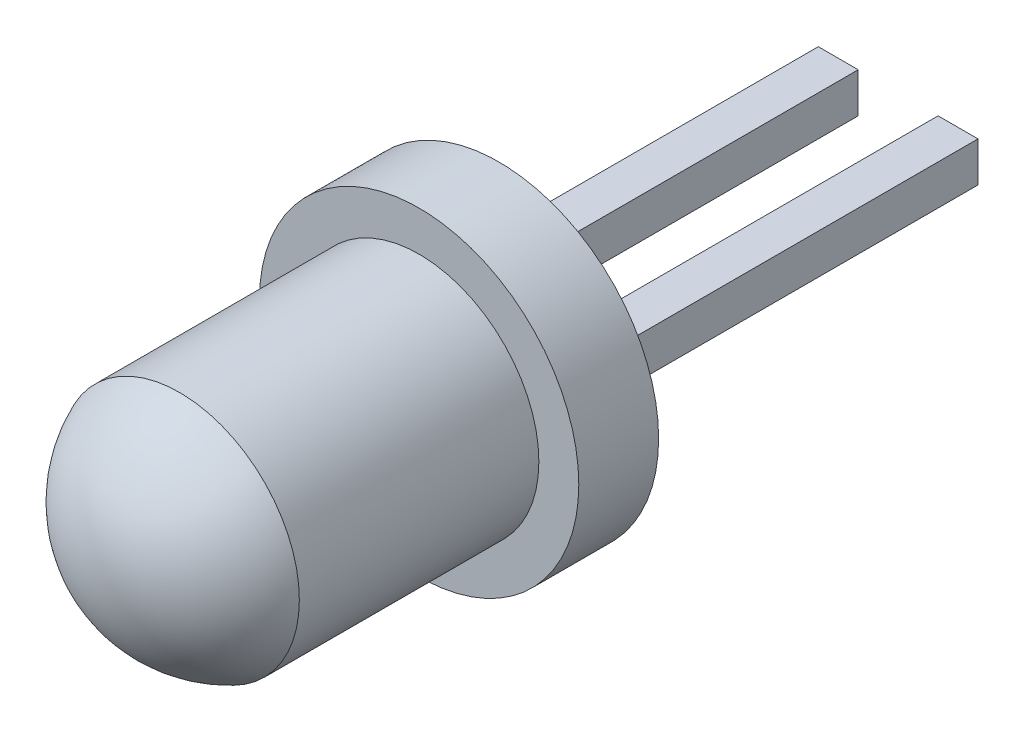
ISO-10303-21;
HEADER;
FILE_DESCRIPTION(('STEP AP214'),'2;1');
FILE_NAME('part.step','',(''),(''),'','','');
FILE_SCHEMA(('AUTOMOTIVE_DESIGN { 1 0 10303 214 1 1 1 1 }'));
ENDSEC;
DATA;
#1=APPLICATION_CONTEXT('core data for automotive mechanical design processes');
#2=APPLICATION_PROTOCOL_DEFINITION('international standard','automotive_design',2000,#1);
#3=PRODUCT_CONTEXT('',#1,'mechanical');
#4=PRODUCT('Part','Part','',(#3));
#5=PRODUCT_RELATED_PRODUCT_CATEGORY('part','',(#4));
#6=PRODUCT_DEFINITION_FORMATION('','',#4);
#7=PRODUCT_DEFINITION_CONTEXT('part definition',#1,'design');
#8=PRODUCT_DEFINITION('design','',#6,#7);
#9=PRODUCT_DEFINITION_SHAPE('','',#8);
#10=(LENGTH_UNIT() NAMED_UNIT(*) SI_UNIT(.MILLI.,.METRE.));
#11=(NAMED_UNIT(*) PLANE_ANGLE_UNIT() SI_UNIT($,.RADIAN.));
#12=(NAMED_UNIT(*) SI_UNIT($,.STERADIAN.) SOLID_ANGLE_UNIT());
#13=UNCERTAINTY_MEASURE_WITH_UNIT(LENGTH_MEASURE(1.E-05),#10,'distance_accuracy_value','');
#14=(GEOMETRIC_REPRESENTATION_CONTEXT(3) GLOBAL_UNCERTAINTY_ASSIGNED_CONTEXT((#13)) GLOBAL_UNIT_ASSIGNED_CONTEXT((#10,
#11,#12)) REPRESENTATION_CONTEXT('',''));
#15=CARTESIAN_POINT('',(0.,0.,0.));
#16=DIRECTION('',(0.,0.,1.));
#17=DIRECTION('',(1.,0.,0.));
#18=AXIS2_PLACEMENT_3D('',#15,#16,#17);
#19=CARTESIAN_POINT('',(0.,0.,-2.00000000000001));
#20=DIRECTION('',(0.,0.,0.999999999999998));
#21=DIRECTION('',(1.,0.,0.));
#22=AXIS2_PLACEMENT_3D('',#19,#20,#21);
#23=PLANE('',#22);
#24=DIRECTION('',(-1.,0.,0.));
#25=VECTOR('',#24,1.);
#26=CARTESIAN_POINT('',(0.499999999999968,0.249999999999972,-1.99999999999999));
#27=LINE('',#26,#25);
#28=CARTESIAN_POINT('',(1.,0.25,-1.99999999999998));
#29=VERTEX_POINT('',#28);
#30=CARTESIAN_POINT('',(0.499999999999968,0.249999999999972,-1.99999999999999));
#31=VERTEX_POINT('',#30);
#32=EDGE_CURVE('E100',#29,#31,#27,.T.);
#33=ORIENTED_EDGE('',*,*,#32,.T.);
#34=DIRECTION('',(0.,-1.,0.));
#35=VECTOR('',#34,1.);
#36=CARTESIAN_POINT('',(0.499999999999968,0.249999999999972,-1.99999999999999));
#37=LINE('',#36,#35);
#38=CARTESIAN_POINT('',(0.500000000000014,-0.25,-1.99999999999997));
#39=VERTEX_POINT('',#38);
#40=EDGE_CURVE('E110',#31,#39,#37,.T.);
#41=ORIENTED_EDGE('',*,*,#40,.T.);
#42=DIRECTION('',(1.,0.,0.));
#43=VECTOR('',#42,1.);
#44=CARTESIAN_POINT('',(0.500000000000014,-0.25,-1.99999999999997));
#45=LINE('',#44,#43);
#46=CARTESIAN_POINT('',(0.999999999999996,-0.25,-1.99999999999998));
#47=VERTEX_POINT('',#46);
#48=EDGE_CURVE('E119',#39,#47,#45,.T.);
#49=ORIENTED_EDGE('',*,*,#48,.T.);
#50=DIRECTION('',(0.,1.,0.));
#51=VECTOR('',#50,1.);
#52=CARTESIAN_POINT('',(1.,0.25,-1.99999999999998));
#53=LINE('',#52,#51);
#54=EDGE_CURVE('E46',#47,#29,#53,.T.);
#55=ORIENTED_EDGE('',*,*,#54,.T.);
#56=EDGE_LOOP('',(#33,#41,#49,#55));
#57=FACE_BOUND('',#56,.T.);
#58=CARTESIAN_POINT('',(0.,0.,-2.00000000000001));
#59=DIRECTION('',(0.,0.,0.999999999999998));
#60=DIRECTION('',(1.,0.,0.));
#61=AXIS2_PLACEMENT_3D('',#58,#59,#60);
#62=CIRCLE('',#61,2.);
#63=CARTESIAN_POINT('',(-2.,0.,-2.00000000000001));
#64=VERTEX_POINT('',#63);
#65=EDGE_CURVE('E11',#64,#64,#62,.T.);
#66=ORIENTED_EDGE('',*,*,#65,.F.);
#67=EDGE_LOOP('',(#66));
#68=FACE_BOUND('',#67,.T.);
#69=DIRECTION('',(0.,-1.,0.));
#70=VECTOR('',#69,1.);
#71=CARTESIAN_POINT('',(-0.500000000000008,0.249999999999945,-1.99999999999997));
#72=LINE('',#71,#70);
#73=CARTESIAN_POINT('',(-0.500000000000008,0.249999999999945,-1.99999999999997));
#74=VERTEX_POINT('',#73);
#75=CARTESIAN_POINT('',(-0.500000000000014,-0.250000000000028,-1.99999999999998));
#76=VERTEX_POINT('',#75);
#77=EDGE_CURVE('E106',#74,#76,#72,.T.);
#78=ORIENTED_EDGE('',*,*,#77,.F.);
#79=DIRECTION('',(1.,0.,0.));
#80=VECTOR('',#79,1.);
#81=CARTESIAN_POINT('',(-0.500000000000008,0.249999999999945,-1.99999999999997));
#82=LINE('',#81,#80);
#83=CARTESIAN_POINT('',(-0.999999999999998,0.25,-1.99999999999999));
#84=VERTEX_POINT('',#83);
#85=EDGE_CURVE('E142',#84,#74,#82,.T.);
#86=ORIENTED_EDGE('',*,*,#85,.F.);
#87=DIRECTION('',(0.,1.,0.));
#88=VECTOR('',#87,1.);
#89=CARTESIAN_POINT('',(-0.999999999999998,0.25,-1.99999999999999));
#90=LINE('',#89,#88);
#91=CARTESIAN_POINT('',(-0.999999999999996,-0.250000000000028,-1.99999999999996));
#92=VERTEX_POINT('',#91);
#93=EDGE_CURVE('E139',#92,#84,#90,.T.);
#94=ORIENTED_EDGE('',*,*,#93,.F.);
#95=DIRECTION('',(-1.,0.,0.));
#96=VECTOR('',#95,1.);
#97=CARTESIAN_POINT('',(-0.500000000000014,-0.250000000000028,-1.99999999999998));
#98=LINE('',#97,#96);
#99=EDGE_CURVE('E54',#76,#92,#98,.T.);
#100=ORIENTED_EDGE('',*,*,#99,.F.);
#101=EDGE_LOOP('',(#78,#86,#94,#100));
#102=FACE_BOUND('',#101,.T.);
#103=ADVANCED_FACE('F31',(#57,#68,#102),#23,.F.);
#104=CARTESIAN_POINT('',(0.,0.,2.));
#105=DIRECTION('',(0.,0.,-0.999999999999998));
#106=DIRECTION('',(-1.,0.,0.));
#107=AXIS2_PLACEMENT_3D('',#104,#105,#106);
#108=CYLINDRICAL_SURFACE('',#107,2.);
#109=CARTESIAN_POINT('',(0.,0.,-1.00000000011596));
#110=DIRECTION('',(0.,0.,0.999999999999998));
#111=DIRECTION('',(1.,0.,0.));
#112=AXIS2_PLACEMENT_3D('',#109,#110,#111);
#113=CIRCLE('',#112,2.);
#114=CARTESIAN_POINT('',(-2.,0.,-1.00000000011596));
#115=VERTEX_POINT('',#114);
#116=EDGE_CURVE('E35',#115,#115,#113,.T.);
#117=CARTESIAN_POINT('',(-2.,0.,-2.00000000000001));
#118=CARTESIAN_POINT('',(-2.,0.,-1.98958333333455));
#119=CARTESIAN_POINT('',(-2.,0.,-1.97916666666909));
#120=CARTESIAN_POINT('',(-2.,0.,-1.95833333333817));
#121=CARTESIAN_POINT('',(-2.,0.,-1.94791666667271));
#122=CARTESIAN_POINT('',(-2.,0.,-1.92708333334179));
#123=CARTESIAN_POINT('',(-2.,0.,-1.91666666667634));
#124=CARTESIAN_POINT('',(-2.,0.,-1.89583333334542));
#125=CARTESIAN_POINT('',(-2.,0.,-1.88541666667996));
#126=CARTESIAN_POINT('',(-2.,0.,-1.86458333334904));
#127=CARTESIAN_POINT('',(-2.,0.,-1.85416666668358));
#128=CARTESIAN_POINT('',(-2.,0.,-1.83333333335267));
#129=CARTESIAN_POINT('',(-2.,0.,-1.82291666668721));
#130=CARTESIAN_POINT('',(-2.,0.,-1.80208333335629));
#131=CARTESIAN_POINT('',(-2.,0.,-1.79166666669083));
#132=CARTESIAN_POINT('',(-2.,0.,-1.77083333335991));
#133=CARTESIAN_POINT('',(-2.,0.,-1.76041666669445));
#134=CARTESIAN_POINT('',(-2.,0.,-1.73958333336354));
#135=CARTESIAN_POINT('',(-2.,0.,-1.72916666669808));
#136=CARTESIAN_POINT('',(-2.,0.,-1.70833333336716));
#137=CARTESIAN_POINT('',(-2.,0.,-1.6979166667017));
#138=CARTESIAN_POINT('',(-2.,0.,-1.67708333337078));
#139=CARTESIAN_POINT('',(-2.,0.,-1.66666666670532));
#140=CARTESIAN_POINT('',(-2.,0.,-1.64583333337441));
#141=CARTESIAN_POINT('',(-2.,0.,-1.63541666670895));
#142=CARTESIAN_POINT('',(-2.,0.,-1.61458333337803));
#143=CARTESIAN_POINT('',(-2.,0.,-1.60416666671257));
#144=CARTESIAN_POINT('',(-2.,0.,-1.58333333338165));
#145=CARTESIAN_POINT('',(-2.,0.,-1.5729166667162));
#146=CARTESIAN_POINT('',(-2.,0.,-1.55208333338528));
#147=CARTESIAN_POINT('',(-2.,0.,-1.54166666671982));
#148=CARTESIAN_POINT('',(-2.,0.,-1.5208333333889));
#149=CARTESIAN_POINT('',(-2.,0.,-1.51041666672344));
#150=CARTESIAN_POINT('',(-2.,0.,-1.48958333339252));
#151=CARTESIAN_POINT('',(-2.,0.,-1.47916666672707));
#152=CARTESIAN_POINT('',(-2.,0.,-1.45833333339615));
#153=CARTESIAN_POINT('',(-2.,0.,-1.44791666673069));
#154=CARTESIAN_POINT('',(-2.,0.,-1.42708333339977));
#155=CARTESIAN_POINT('',(-2.,0.,-1.41666666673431));
#156=CARTESIAN_POINT('',(-2.,0.,-1.3958333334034));
#157=CARTESIAN_POINT('',(-2.,0.,-1.38541666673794));
#158=CARTESIAN_POINT('',(-2.,0.,-1.36458333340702));
#159=CARTESIAN_POINT('',(-2.,0.,-1.35416666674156));
#160=CARTESIAN_POINT('',(-2.,0.,-1.33333333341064));
#161=CARTESIAN_POINT('',(-2.,0.,-1.32291666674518));
#162=CARTESIAN_POINT('',(-2.,0.,-1.30208333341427));
#163=CARTESIAN_POINT('',(-2.,0.,-1.29166666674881));
#164=CARTESIAN_POINT('',(-2.,0.,-1.27083333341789));
#165=CARTESIAN_POINT('',(-2.,0.,-1.26041666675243));
#166=CARTESIAN_POINT('',(-2.,0.,-1.23958333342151));
#167=CARTESIAN_POINT('',(-2.,0.,-1.22916666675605));
#168=CARTESIAN_POINT('',(-2.,0.,-1.20833333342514));
#169=CARTESIAN_POINT('',(-2.,0.,-1.19791666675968));
#170=CARTESIAN_POINT('',(-2.,0.,-1.17708333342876));
#171=CARTESIAN_POINT('',(-2.,0.,-1.1666666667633));
#172=CARTESIAN_POINT('',(-2.,0.,-1.14583333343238));
#173=CARTESIAN_POINT('',(-2.,0.,-1.13541666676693));
#174=CARTESIAN_POINT('',(-2.,0.,-1.11458333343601));
#175=CARTESIAN_POINT('',(-2.,0.,-1.10416666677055));
#176=CARTESIAN_POINT('',(-2.,0.,-1.08333333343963));
#177=CARTESIAN_POINT('',(-2.,0.,-1.07291666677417));
#178=CARTESIAN_POINT('',(-2.,0.,-1.05208333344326));
#179=CARTESIAN_POINT('',(-2.,0.,-1.0416666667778));
#180=CARTESIAN_POINT('',(-2.,0.,-1.02083333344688));
#181=CARTESIAN_POINT('',(-2.,0.,-1.01041666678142));
#182=CARTESIAN_POINT('',(-2.,0.,-1.00000000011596));
#183=B_SPLINE_CURVE_WITH_KNOTS('',3,(#117,#118,#119,#120,#121,#122,#123,#124,#125,#126,#127,
#128,#129,#130,#131,#132,#133,#134,#135,#136,#137,#138,#139,#140,#141,#142,#143,#144,#145,#146,
#147,#148,#149,#150,#151,#152,#153,#154,#155,#156,#157,#158,#159,#160,#161,#162,#163,#164,#165,
#166,#167,#168,#169,#170,#171,#172,#173,#174,#175,#176,#177,#178,#179,#180,#181,#182),
.UNSPECIFIED.,.F.,.F.,(4,2,2,2,2,2,2,2,2,2,2,2,2,2,2,2,2,2,2,2,2,2,2,2,2,2,2,2,2,2,2,2,4),(0.,
0.0312499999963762,0.0624999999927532,0.0937499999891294,0.124999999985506,0.156249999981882,
0.187499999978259,0.218749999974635,0.249999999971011,0.281249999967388,0.312499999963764,
0.343749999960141,0.374999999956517,0.406249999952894,0.43749999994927,0.468749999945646,
0.499999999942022,0.531249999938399,0.562499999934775,0.593749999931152,0.624999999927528,
0.656249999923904,0.687499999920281,0.718749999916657,0.749999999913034,0.78124999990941,
0.812499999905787,0.843749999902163,0.874999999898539,0.906249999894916,0.937499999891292,
0.968749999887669,0.999999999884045),.UNSPECIFIED.);
#184=EDGE_CURVE('BSEAM177',#64,#115,#183,.T.);
#185=ORIENTED_EDGE('',*,*,#65,.T.);
#186=ORIENTED_EDGE('',*,*,#116,.F.);
#187=ORIENTED_EDGE('',*,*,#184,.T.);
#188=ORIENTED_EDGE('',*,*,#184,.F.);
#189=EDGE_LOOP('',(#185,#187,#186,#188));
#190=FACE_BOUND('',#189,.T.);
#191=ADVANCED_FACE('F177',(#190),#108,.T.);
#192=CARTESIAN_POINT('',(-10.1594783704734,0.,-1.00000000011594));
#193=DIRECTION('',(0.,0.,0.999999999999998));
#194=DIRECTION('',(1.,0.,0.));
#195=AXIS2_PLACEMENT_3D('',#192,#193,#194);
#196=PLANE('',#195);
#197=CARTESIAN_POINT('',(0.,0.,-1.00000000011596));
#198=DIRECTION('',(0.,0.,0.999999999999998));
#199=DIRECTION('',(1.,0.,0.));
#200=AXIS2_PLACEMENT_3D('',#197,#198,#199);
#201=CIRCLE('',#200,1.5);
#202=CARTESIAN_POINT('',(1.50000000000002,0.,-1.00000000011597));
#203=VERTEX_POINT('',#202);
#204=EDGE_CURVE('E168',#203,#203,#201,.T.);
#205=ORIENTED_EDGE('',*,*,#204,.F.);
#206=EDGE_LOOP('',(#205));
#207=FACE_BOUND('',#206,.T.);
#208=ORIENTED_EDGE('',*,*,#116,.T.);
#209=EDGE_LOOP('',(#208));
#210=FACE_BOUND('',#209,.T.);
#211=ADVANCED_FACE('F175',(#207,#210),#196,.T.);
#212=CARTESIAN_POINT('',(0.,0.,-1.00000000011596));
#213=DIRECTION('',(0.,0.,0.999999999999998));
#214=DIRECTION('',(1.,0.,0.));
#215=AXIS2_PLACEMENT_3D('',#212,#213,#214);
#216=CYLINDRICAL_SURFACE('',#215,1.5);
#217=CARTESIAN_POINT('',(0.,0.,1.99999999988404));
#218=DIRECTION('',(0.,0.,0.999999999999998));
#219=DIRECTION('',(1.,0.,0.));
#220=AXIS2_PLACEMENT_3D('',#217,#218,#219);
#221=CIRCLE('',#220,1.5);
#222=CARTESIAN_POINT('',(1.50000000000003,0.,1.99999999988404));
#223=VERTEX_POINT('',#222);
#224=EDGE_CURVE('E165',#223,#223,#221,.T.);
#225=CARTESIAN_POINT('',(1.50000000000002,0.,-1.00000000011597));
#226=CARTESIAN_POINT('',(1.50000000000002,0.,-0.968750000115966));
#227=CARTESIAN_POINT('',(1.50000000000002,0.,-0.937500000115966));
#228=CARTESIAN_POINT('',(1.50000000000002,0.,-0.875000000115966));
#229=CARTESIAN_POINT('',(1.50000000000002,0.,-0.843750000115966));
#230=CARTESIAN_POINT('',(1.50000000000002,0.,-0.781250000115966));
#231=CARTESIAN_POINT('',(1.50000000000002,0.,-0.750000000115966));
#232=CARTESIAN_POINT('',(1.50000000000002,0.,-0.687500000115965));
#233=CARTESIAN_POINT('',(1.50000000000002,0.,-0.656250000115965));
#234=CARTESIAN_POINT('',(1.50000000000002,0.,-0.593750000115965));
#235=CARTESIAN_POINT('',(1.50000000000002,0.,-0.562500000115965));
#236=CARTESIAN_POINT('',(1.50000000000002,0.,-0.500000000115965));
#237=CARTESIAN_POINT('',(1.50000000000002,0.,-0.468750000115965));
#238=CARTESIAN_POINT('',(1.50000000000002,0.,-0.406250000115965));
#239=CARTESIAN_POINT('',(1.50000000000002,0.,-0.375000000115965));
#240=CARTESIAN_POINT('',(1.50000000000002,0.,-0.312500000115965));
#241=CARTESIAN_POINT('',(1.50000000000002,0.,-0.281250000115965));
#242=CARTESIAN_POINT('',(1.50000000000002,0.,-0.218750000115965));
#243=CARTESIAN_POINT('',(1.50000000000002,0.,-0.187500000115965));
#244=CARTESIAN_POINT('',(1.50000000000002,0.,-0.125000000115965));
#245=CARTESIAN_POINT('',(1.50000000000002,0.,-0.0937500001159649));
#246=CARTESIAN_POINT('',(1.50000000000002,0.,-0.0312500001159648));
#247=CARTESIAN_POINT('',(1.50000000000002,0.,-1.15964746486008E-10));
#248=CARTESIAN_POINT('',(1.50000000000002,0.,0.0624999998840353));
#249=CARTESIAN_POINT('',(1.50000000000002,0.,0.0937499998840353));
#250=CARTESIAN_POINT('',(1.50000000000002,0.,0.156249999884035));
#251=CARTESIAN_POINT('',(1.50000000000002,0.,0.187499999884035));
#252=CARTESIAN_POINT('',(1.50000000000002,0.,0.249999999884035));
#253=CARTESIAN_POINT('',(1.50000000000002,0.,0.281249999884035));
#254=CARTESIAN_POINT('',(1.50000000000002,0.,0.343749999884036));
#255=CARTESIAN_POINT('',(1.50000000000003,0.,0.374999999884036));
#256=CARTESIAN_POINT('',(1.50000000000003,0.,0.437499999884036));
#257=CARTESIAN_POINT('',(1.50000000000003,0.,0.468749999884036));
#258=CARTESIAN_POINT('',(1.50000000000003,0.,0.531249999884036));
#259=CARTESIAN_POINT('',(1.50000000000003,0.,0.562499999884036));
#260=CARTESIAN_POINT('',(1.50000000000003,0.,0.624999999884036));
#261=CARTESIAN_POINT('',(1.50000000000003,0.,0.656249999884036));
#262=CARTESIAN_POINT('',(1.50000000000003,0.,0.718749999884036));
#263=CARTESIAN_POINT('',(1.50000000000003,0.,0.749999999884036));
#264=CARTESIAN_POINT('',(1.50000000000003,0.,0.812499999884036));
#265=CARTESIAN_POINT('',(1.50000000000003,0.,0.843749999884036));
#266=CARTESIAN_POINT('',(1.50000000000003,0.,0.906249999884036));
#267=CARTESIAN_POINT('',(1.50000000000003,0.,0.937499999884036));
#268=CARTESIAN_POINT('',(1.50000000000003,0.,0.999999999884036));
#269=CARTESIAN_POINT('',(1.50000000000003,0.,1.03124999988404));
#270=CARTESIAN_POINT('',(1.50000000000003,0.,1.09374999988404));
#271=CARTESIAN_POINT('',(1.50000000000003,0.,1.12499999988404));
#272=CARTESIAN_POINT('',(1.50000000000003,0.,1.18749999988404));
#273=CARTESIAN_POINT('',(1.50000000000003,0.,1.21874999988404));
#274=CARTESIAN_POINT('',(1.50000000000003,0.,1.28124999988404));
#275=CARTESIAN_POINT('',(1.50000000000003,0.,1.31249999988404));
#276=CARTESIAN_POINT('',(1.50000000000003,0.,1.37499999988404));
#277=CARTESIAN_POINT('',(1.50000000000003,0.,1.40624999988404));
#278=CARTESIAN_POINT('',(1.50000000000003,0.,1.46874999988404));
#279=CARTESIAN_POINT('',(1.50000000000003,0.,1.49999999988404));
#280=CARTESIAN_POINT('',(1.50000000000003,0.,1.56249999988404));
#281=CARTESIAN_POINT('',(1.50000000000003,0.,1.59374999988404));
#282=CARTESIAN_POINT('',(1.50000000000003,0.,1.65624999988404));
#283=CARTESIAN_POINT('',(1.50000000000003,0.,1.68749999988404));
#284=CARTESIAN_POINT('',(1.50000000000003,0.,1.74999999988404));
#285=CARTESIAN_POINT('',(1.50000000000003,0.,1.78124999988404));
#286=CARTESIAN_POINT('',(1.50000000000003,0.,1.84374999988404));
#287=CARTESIAN_POINT('',(1.50000000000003,0.,1.87499999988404));
#288=CARTESIAN_POINT('',(1.50000000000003,0.,1.93749999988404));
#289=CARTESIAN_POINT('',(1.50000000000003,0.,1.96874999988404));
#290=CARTESIAN_POINT('',(1.50000000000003,0.,1.99999999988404));
#291=B_SPLINE_CURVE_WITH_KNOTS('',3,(#225,#226,#227,#228,#229,#230,#231,#232,#233,#234,#235,
#236,#237,#238,#239,#240,#241,#242,#243,#244,#245,#246,#247,#248,#249,#250,#251,#252,#253,#254,
#255,#256,#257,#258,#259,#260,#261,#262,#263,#264,#265,#266,#267,#268,#269,#270,#271,#272,#273,
#274,#275,#276,#277,#278,#279,#280,#281,#282,#283,#284,#285,#286,#287,#288,#289,#290),
.UNSPECIFIED.,.F.,.F.,(4,2,2,2,2,2,2,2,2,2,2,2,2,2,2,2,2,2,2,2,2,2,2,2,2,2,2,2,2,2,2,2,4),(0.,
0.09375,0.1875,0.28125,0.375,0.46875,0.5625,0.65625,0.750000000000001,0.843750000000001,
0.937500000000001,1.03125,1.125,1.21875,1.3125,1.40625,1.5,1.59375,1.6875,1.78125,1.875,1.96875,
2.0625,2.15625,2.25,2.34375,2.4375,2.53125,2.625,2.71875,2.8125,2.90625,3.),.UNSPECIFIED.);
#292=EDGE_CURVE('BSEAM184',#203,#223,#291,.T.);
#293=ORIENTED_EDGE('',*,*,#204,.T.);
#294=ORIENTED_EDGE('',*,*,#224,.F.);
#295=ORIENTED_EDGE('',*,*,#292,.T.);
#296=ORIENTED_EDGE('',*,*,#292,.F.);
#297=EDGE_LOOP('',(#293,#295,#294,#296));
#298=FACE_BOUND('',#297,.T.);
#299=ADVANCED_FACE('F184',(#298),#216,.T.);
#300=CARTESIAN_POINT('',(0.,0.,1.37499999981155));
#301=DIRECTION('',(0.,0.,0.999999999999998));
#302=DIRECTION('',(1.,0.,0.));
#303=AXIS2_PLACEMENT_3D('',#300,#301,#302);
#304=SPHERICAL_SURFACE('',#303,1.62500000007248);
#305=ORIENTED_EDGE('',*,*,#224,.T.);
#306=EDGE_LOOP('',(#305));
#307=FACE_BOUND('',#306,.T.);
#308=ADVANCED_FACE('F33',(#307),#304,.T.);
#309=CARTESIAN_POINT('',(-0.500000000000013,0.249999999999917,-6.99999999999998));
#310=DIRECTION('',(-1.,0.,0.));
#311=DIRECTION('',(0.,-1.,0.));
#312=AXIS2_PLACEMENT_3D('',#309,#310,#311);
#313=PLANE('',#312);
#314=ORIENTED_EDGE('',*,*,#77,.T.);
#315=DIRECTION('',(0.,0.,0.999999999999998));
#316=VECTOR('',#315,1.);
#317=CARTESIAN_POINT('',(-0.499999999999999,-0.249999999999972,-6.99999999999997));
#318=LINE('',#317,#316);
#319=CARTESIAN_POINT('',(-0.499999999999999,-0.249999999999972,-6.99999999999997));
#320=VERTEX_POINT('',#319);
#321=EDGE_CURVE('E163',#320,#76,#318,.T.);
#322=ORIENTED_EDGE('',*,*,#321,.F.);
#323=DIRECTION('',(0.,-1.,0.));
#324=VECTOR('',#323,1.);
#325=CARTESIAN_POINT('',(-0.500000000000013,0.249999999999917,-6.99999999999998));
#326=LINE('',#325,#324);
#327=CARTESIAN_POINT('',(-0.500000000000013,0.249999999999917,-6.99999999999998));
#328=VERTEX_POINT('',#327);
#329=EDGE_CURVE('E145',#328,#320,#326,.T.);
#330=ORIENTED_EDGE('',*,*,#329,.F.);
#331=DIRECTION('',(0.,0.,0.999999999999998));
#332=VECTOR('',#331,1.);
#333=CARTESIAN_POINT('',(-0.500000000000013,0.249999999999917,-6.99999999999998));
#334=LINE('',#333,#332);
#335=EDGE_CURVE('E154',#328,#74,#334,.T.);
#336=ORIENTED_EDGE('',*,*,#335,.T.);
#337=EDGE_LOOP('',(#314,#322,#330,#336));
#338=FACE_BOUND('',#337,.T.);
#339=ADVANCED_FACE('F191',(#338),#313,.F.);
#340=CARTESIAN_POINT('',(-0.499999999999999,-0.249999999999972,-6.99999999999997));
#341=DIRECTION('',(0.,1.,0.));
#342=DIRECTION('',(-1.,0.,0.));
#343=AXIS2_PLACEMENT_3D('',#340,#341,#342);
#344=PLANE('',#343);
#345=ORIENTED_EDGE('',*,*,#99,.T.);
#346=DIRECTION('',(0.,0.,0.999999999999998));
#347=VECTOR('',#346,1.);
#348=CARTESIAN_POINT('',(-1.,-0.25,-6.99999999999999));
#349=LINE('',#348,#347);
#350=CARTESIAN_POINT('',(-1.,-0.25,-6.99999999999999));
#351=VERTEX_POINT('',#350);
#352=EDGE_CURVE('E160',#351,#92,#349,.T.);
#353=ORIENTED_EDGE('',*,*,#352,.F.);
#354=DIRECTION('',(-1.,0.,0.));
#355=VECTOR('',#354,1.);
#356=CARTESIAN_POINT('',(-0.499999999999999,-0.249999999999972,-6.99999999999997));
#357=LINE('',#356,#355);
#358=EDGE_CURVE('E148',#320,#351,#357,.T.);
#359=ORIENTED_EDGE('',*,*,#358,.F.);
#360=ORIENTED_EDGE('',*,*,#321,.T.);
#361=EDGE_LOOP('',(#345,#353,#359,#360));
#362=FACE_BOUND('',#361,.T.);
#363=ADVANCED_FACE('F194',(#362),#344,.F.);
#364=CARTESIAN_POINT('',(-0.999999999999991,0.25,-6.99999999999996));
#365=DIRECTION('',(1.,0.,0.));
#366=DIRECTION('',(0.,0.,-0.999999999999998));
#367=AXIS2_PLACEMENT_3D('',#364,#365,#366);
#368=PLANE('',#367);
#369=ORIENTED_EDGE('',*,*,#93,.T.);
#370=DIRECTION('',(0.,0.,0.999999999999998));
#371=VECTOR('',#370,1.);
#372=CARTESIAN_POINT('',(-0.999999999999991,0.25,-6.99999999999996));
#373=LINE('',#372,#371);
#374=CARTESIAN_POINT('',(-0.999999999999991,0.25,-6.99999999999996));
#375=VERTEX_POINT('',#374);
#376=EDGE_CURVE('E157',#375,#84,#373,.T.);
#377=ORIENTED_EDGE('',*,*,#376,.F.);
#378=DIRECTION('',(0.,1.,0.));
#379=VECTOR('',#378,1.);
#380=CARTESIAN_POINT('',(-0.999999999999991,0.25,-6.99999999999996));
#381=LINE('',#380,#379);
#382=EDGE_CURVE('E150',#351,#375,#381,.T.);
#383=ORIENTED_EDGE('',*,*,#382,.F.);
#384=ORIENTED_EDGE('',*,*,#352,.T.);
#385=EDGE_LOOP('',(#369,#377,#383,#384));
#386=FACE_BOUND('',#385,.T.);
#387=ADVANCED_FACE('F198',(#386),#368,.F.);
#388=CARTESIAN_POINT('',(-0.500000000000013,0.249999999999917,-6.99999999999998));
#389=DIRECTION('',(0.,-1.,0.));
#390=DIRECTION('',(1.,0.,0.));
#391=AXIS2_PLACEMENT_3D('',#388,#389,#390);
#392=PLANE('',#391);
#393=ORIENTED_EDGE('',*,*,#85,.T.);
#394=ORIENTED_EDGE('',*,*,#335,.F.);
#395=DIRECTION('',(1.,0.,0.));
#396=VECTOR('',#395,1.);
#397=CARTESIAN_POINT('',(-0.500000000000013,0.249999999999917,-6.99999999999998));
#398=LINE('',#397,#396);
#399=EDGE_CURVE('E152',#375,#328,#398,.T.);
#400=ORIENTED_EDGE('',*,*,#399,.F.);
#401=ORIENTED_EDGE('',*,*,#376,.T.);
#402=EDGE_LOOP('',(#393,#394,#400,#401));
#403=FACE_BOUND('',#402,.T.);
#404=ADVANCED_FACE('F202',(#403),#392,.F.);
#405=CARTESIAN_POINT('',(-0.500000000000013,0.249999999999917,-6.99999999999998));
#406=DIRECTION('',(0.,0.,-0.999999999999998));
#407=DIRECTION('',(-1.,0.,0.));
#408=AXIS2_PLACEMENT_3D('',#405,#406,#407);
#409=PLANE('',#408);
#410=ORIENTED_EDGE('',*,*,#329,.T.);
#411=ORIENTED_EDGE('',*,*,#358,.T.);
#412=ORIENTED_EDGE('',*,*,#382,.T.);
#413=ORIENTED_EDGE('',*,*,#399,.T.);
#414=EDGE_LOOP('',(#410,#411,#412,#413));
#415=FACE_BOUND('',#414,.T.);
#416=ADVANCED_FACE('F206',(#415),#409,.T.);
#417=CARTESIAN_POINT('',(0.49999999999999,0.25,-6.99999999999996));
#418=DIRECTION('',(-1.,0.,0.));
#419=DIRECTION('',(0.,-1.,0.));
#420=AXIS2_PLACEMENT_3D('',#417,#418,#419);
#421=PLANE('',#420);
#422=ORIENTED_EDGE('',*,*,#40,.F.);
#423=DIRECTION('',(0.,0.,0.999999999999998));
#424=VECTOR('',#423,1.);
#425=CARTESIAN_POINT('',(0.49999999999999,0.25,-6.99999999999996));
#426=LINE('',#425,#424);
#427=CARTESIAN_POINT('',(0.49999999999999,0.25,-6.99999999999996));
#428=VERTEX_POINT('',#427);
#429=EDGE_CURVE('E96',#428,#31,#426,.T.);
#430=ORIENTED_EDGE('',*,*,#429,.F.);
#431=DIRECTION('',(0.,-1.,0.));
#432=VECTOR('',#431,1.);
#433=CARTESIAN_POINT('',(0.49999999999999,0.25,-6.99999999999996));
#434=LINE('',#433,#432);
#435=CARTESIAN_POINT('',(0.499999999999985,-0.25,-6.99999999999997));
#436=VERTEX_POINT('',#435);
#437=EDGE_CURVE('E123',#428,#436,#434,.T.);
#438=ORIENTED_EDGE('',*,*,#437,.T.);
#439=DIRECTION('',(0.,0.,0.999999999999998));
#440=VECTOR('',#439,1.);
#441=CARTESIAN_POINT('',(0.499999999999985,-0.25,-6.99999999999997));
#442=LINE('',#441,#440);
#443=EDGE_CURVE('E112',#436,#39,#442,.T.);
#444=ORIENTED_EDGE('',*,*,#443,.T.);
#445=EDGE_LOOP('',(#422,#430,#438,#444));
#446=FACE_BOUND('',#445,.T.);
#447=ADVANCED_FACE('F111',(#446),#421,.T.);
#448=CARTESIAN_POINT('',(0.49999999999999,0.25,-6.99999999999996));
#449=DIRECTION('',(0.,1.,0.));
#450=DIRECTION('',(-1.,0.,0.));
#451=AXIS2_PLACEMENT_3D('',#448,#449,#450);
#452=PLANE('',#451);
#453=ORIENTED_EDGE('',*,*,#32,.F.);
#454=DIRECTION('',(0.,0.,0.999999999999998));
#455=VECTOR('',#454,1.);
#456=CARTESIAN_POINT('',(0.999999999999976,0.249999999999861,-7.00000000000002));
#457=LINE('',#456,#455);
#458=CARTESIAN_POINT('',(0.999999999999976,0.249999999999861,-7.00000000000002));
#459=VERTEX_POINT('',#458);
#460=EDGE_CURVE('E107',#459,#29,#457,.T.);
#461=ORIENTED_EDGE('',*,*,#460,.F.);
#462=DIRECTION('',(-1.,0.,0.));
#463=VECTOR('',#462,1.);
#464=CARTESIAN_POINT('',(0.49999999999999,0.25,-6.99999999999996));
#465=LINE('',#464,#463);
#466=EDGE_CURVE('E102',#459,#428,#465,.T.);
#467=ORIENTED_EDGE('',*,*,#466,.T.);
#468=ORIENTED_EDGE('',*,*,#429,.T.);
#469=EDGE_LOOP('',(#453,#461,#467,#468));
#470=FACE_BOUND('',#469,.T.);
#471=ADVANCED_FACE('F98',(#470),#452,.T.);
#472=CARTESIAN_POINT('',(0.999999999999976,0.249999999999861,-7.00000000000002));
#473=DIRECTION('',(1.,0.,0.));
#474=DIRECTION('',(0.,0.,-0.999999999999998));
#475=AXIS2_PLACEMENT_3D('',#472,#473,#474);
#476=PLANE('',#475);
#477=ORIENTED_EDGE('',*,*,#54,.F.);
#478=DIRECTION('',(0.,0.,0.999999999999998));
#479=VECTOR('',#478,1.);
#480=CARTESIAN_POINT('',(0.99999999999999,-0.25,-6.99999999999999));
#481=LINE('',#480,#479);
#482=CARTESIAN_POINT('',(0.99999999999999,-0.25,-6.99999999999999));
#483=VERTEX_POINT('',#482);
#484=EDGE_CURVE('E133',#483,#47,#481,.T.);
#485=ORIENTED_EDGE('',*,*,#484,.F.);
#486=DIRECTION('',(0.,1.,0.));
#487=VECTOR('',#486,1.);
#488=CARTESIAN_POINT('',(0.999999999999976,0.249999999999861,-7.00000000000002));
#489=LINE('',#488,#487);
#490=EDGE_CURVE('E126',#483,#459,#489,.T.);
#491=ORIENTED_EDGE('',*,*,#490,.T.);
#492=ORIENTED_EDGE('',*,*,#460,.T.);
#493=EDGE_LOOP('',(#477,#485,#491,#492));
#494=FACE_BOUND('',#493,.T.);
#495=ADVANCED_FACE('F215',(#494),#476,.T.);
#496=CARTESIAN_POINT('',(0.499999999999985,-0.25,-6.99999999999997));
#497=DIRECTION('',(0.,-1.,0.));
#498=DIRECTION('',(1.,0.,0.));
#499=AXIS2_PLACEMENT_3D('',#496,#497,#498);
#500=PLANE('',#499);
#501=ORIENTED_EDGE('',*,*,#48,.F.);
#502=ORIENTED_EDGE('',*,*,#443,.F.);
#503=DIRECTION('',(1.,0.,0.));
#504=VECTOR('',#503,1.);
#505=CARTESIAN_POINT('',(0.499999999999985,-0.25,-6.99999999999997));
#506=LINE('',#505,#504);
#507=EDGE_CURVE('E129',#436,#483,#506,.T.);
#508=ORIENTED_EDGE('',*,*,#507,.T.);
#509=ORIENTED_EDGE('',*,*,#484,.T.);
#510=EDGE_LOOP('',(#501,#502,#508,#509));
#511=FACE_BOUND('',#510,.T.);
#512=ADVANCED_FACE('F218',(#511),#500,.T.);
#513=CARTESIAN_POINT('',(0.49999999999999,0.25,-6.99999999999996));
#514=DIRECTION('',(0.,0.,-0.999999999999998));
#515=DIRECTION('',(1.,0.,0.));
#516=AXIS2_PLACEMENT_3D('',#513,#514,#515);
#517=PLANE('',#516);
#518=ORIENTED_EDGE('',*,*,#437,.F.);
#519=ORIENTED_EDGE('',*,*,#466,.F.);
#520=ORIENTED_EDGE('',*,*,#490,.F.);
#521=ORIENTED_EDGE('',*,*,#507,.F.);
#522=EDGE_LOOP('',(#518,#519,#520,#521));
#523=FACE_BOUND('',#522,.T.);
#524=ADVANCED_FACE('F221',(#523),#517,.T.);
#525=CLOSED_SHELL('',(#103,#191,#211,#299,#308,#339,#363,#387,#404,#416,#447,#471,#495,#512,#524));
#526=MANIFOLD_SOLID_BREP('B2',#525);
#527=ADVANCED_BREP_SHAPE_REPRESENTATION('',(#18,#526),#14);
#528=SHAPE_DEFINITION_REPRESENTATION(#9,#527);
ENDSEC;
END-ISO-10303-21;
